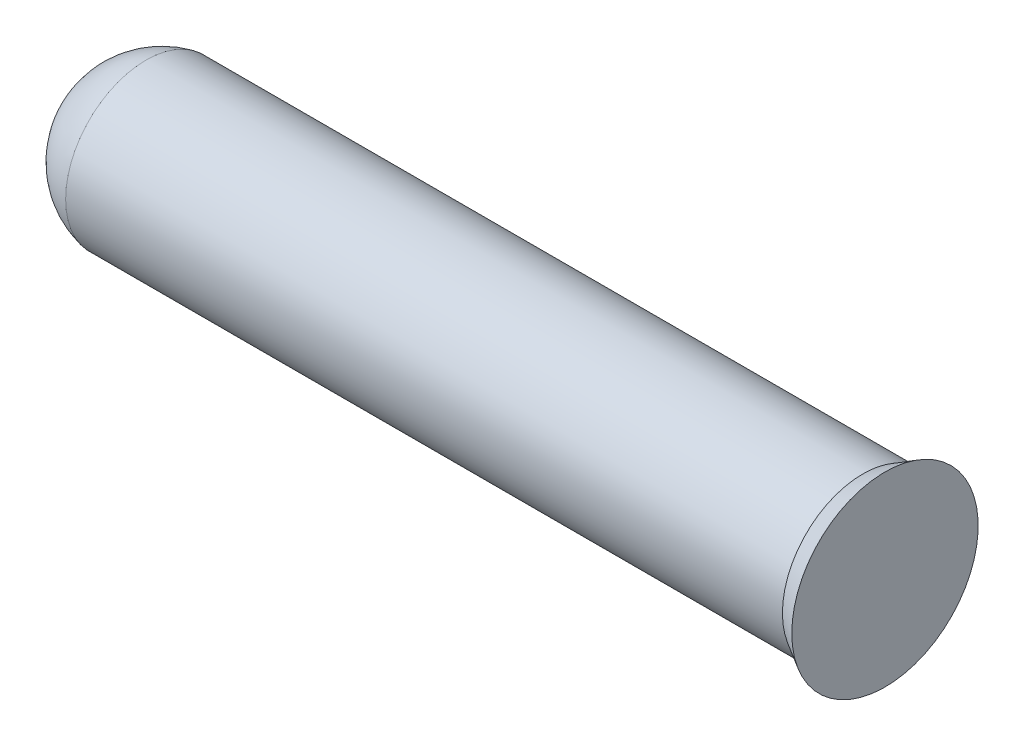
ISO-10303-21;
HEADER;
FILE_DESCRIPTION(('STEP AP214'),'2;1');
FILE_NAME('part.step','',(''),(''),'','','');
FILE_SCHEMA(('AUTOMOTIVE_DESIGN { 1 0 10303 214 1 1 1 1 }'));
ENDSEC;
DATA;
#1=APPLICATION_CONTEXT('core data for automotive mechanical design processes');
#2=APPLICATION_PROTOCOL_DEFINITION('international standard','automotive_design',2000,#1);
#3=PRODUCT_CONTEXT('',#1,'mechanical');
#4=PRODUCT('Part','Part','',(#3));
#5=PRODUCT_RELATED_PRODUCT_CATEGORY('part','',(#4));
#6=PRODUCT_DEFINITION_FORMATION('','',#4);
#7=PRODUCT_DEFINITION_CONTEXT('part definition',#1,'design');
#8=PRODUCT_DEFINITION('design','',#6,#7);
#9=PRODUCT_DEFINITION_SHAPE('','',#8);
#10=(LENGTH_UNIT() NAMED_UNIT(*) SI_UNIT(.MILLI.,.METRE.));
#11=(NAMED_UNIT(*) PLANE_ANGLE_UNIT() SI_UNIT($,.RADIAN.));
#12=(NAMED_UNIT(*) SI_UNIT($,.STERADIAN.) SOLID_ANGLE_UNIT());
#13=UNCERTAINTY_MEASURE_WITH_UNIT(LENGTH_MEASURE(1.E-05),#10,'distance_accuracy_value','');
#14=(GEOMETRIC_REPRESENTATION_CONTEXT(3) GLOBAL_UNCERTAINTY_ASSIGNED_CONTEXT((#13)) GLOBAL_UNIT_ASSIGNED_CONTEXT((#10,
#11,#12)) REPRESENTATION_CONTEXT('',''));
#15=CARTESIAN_POINT('',(0.,0.,0.));
#16=DIRECTION('',(0.,0.,1.));
#17=DIRECTION('',(1.,0.,0.));
#18=AXIS2_PLACEMENT_3D('',#15,#16,#17);
#19=CARTESIAN_POINT('',(2.032,0.,0.));
#20=DIRECTION('',(-1.,0.,0.));
#21=DIRECTION('',(0.,1.,0.));
#22=AXIS2_PLACEMENT_3D('',#19,#20,#21);
#23=SPHERICAL_SURFACE('',#22,2.032);
#24=CARTESIAN_POINT('',(1.64086319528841,0.,0.));
#25=DIRECTION('',(-1.,0.,0.));
#26=DIRECTION('',(0.,0.,1.));
#27=AXIS2_PLACEMENT_3D('',#24,#25,#26);
#28=CIRCLE('',#27,1.994);
#29=CARTESIAN_POINT('',(1.64086319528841,0.,1.994));
#30=VERTEX_POINT('',#29);
#31=EDGE_CURVE('E40',#30,#30,#28,.T.);
#32=ORIENTED_EDGE('',*,*,#31,.T.);
#33=EDGE_LOOP('',(#32));
#34=FACE_BOUND('',#33,.T.);
#35=ADVANCED_FACE('F30',(#34),#23,.T.);
#36=CARTESIAN_POINT('',(19.964,0.,0.));
#37=DIRECTION('',(-1.,0.,0.));
#38=DIRECTION('',(0.,0.,1.));
#39=AXIS2_PLACEMENT_3D('',#36,#37,#38);
#40=PLANE('',#39);
#41=CARTESIAN_POINT('',(19.964,0.,0.));
#42=DIRECTION('',(-1.,0.,0.));
#43=DIRECTION('',(0.,0.,1.));
#44=AXIS2_PLACEMENT_3D('',#41,#42,#43);
#45=CIRCLE('',#44,2.311);
#46=CARTESIAN_POINT('',(19.964,0.,2.311));
#47=VERTEX_POINT('',#46);
#48=EDGE_CURVE('E10',#47,#47,#45,.T.);
#49=ORIENTED_EDGE('',*,*,#48,.F.);
#50=EDGE_LOOP('',(#49));
#51=FACE_BOUND('',#50,.T.);
#52=ADVANCED_FACE('F55',(#51),#40,.F.);
#53=CARTESIAN_POINT('',(19.964,0.,0.));
#54=DIRECTION('',(1.,0.,0.));
#55=DIRECTION('',(0.,0.,-1.));
#56=AXIS2_PLACEMENT_3D('',#53,#54,#55);
#57=CONICAL_SURFACE('',#56,2.311,0.523598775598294);
#58=CARTESIAN_POINT('',(19.4149398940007,0.,0.));
#59=DIRECTION('',(-1.,0.,0.));
#60=DIRECTION('',(0.,0.,1.));
#61=AXIS2_PLACEMENT_3D('',#58,#59,#60);
#62=CIRCLE('',#61,1.994);
#63=CARTESIAN_POINT('',(19.4149398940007,0.,1.994));
#64=VERTEX_POINT('',#63);
#65=EDGE_CURVE('E36',#64,#64,#62,.T.);
#66=ORIENTED_EDGE('',*,*,#65,.F.);
#67=EDGE_LOOP('',(#66));
#68=FACE_BOUND('',#67,.T.);
#69=ORIENTED_EDGE('',*,*,#48,.T.);
#70=EDGE_LOOP('',(#69));
#71=FACE_BOUND('',#70,.T.);
#72=ADVANCED_FACE('F50',(#68,#71),#57,.T.);
#73=CARTESIAN_POINT('',(0.,0.,0.));
#74=DIRECTION('',(-1.,0.,0.));
#75=DIRECTION('',(0.,0.,1.));
#76=AXIS2_PLACEMENT_3D('',#73,#74,#75);
#77=CYLINDRICAL_SURFACE('',#76,1.994);
#78=ORIENTED_EDGE('',*,*,#31,.F.);
#79=EDGE_LOOP('',(#78));
#80=FACE_BOUND('',#79,.T.);
#81=ORIENTED_EDGE('',*,*,#65,.T.);
#82=EDGE_LOOP('',(#81));
#83=FACE_BOUND('',#82,.T.);
#84=ADVANCED_FACE('F48',(#80,#83),#77,.T.);
#85=CLOSED_SHELL('',(#35,#52,#72,#84));
#86=MANIFOLD_SOLID_BREP('B2',#85);
#87=ADVANCED_BREP_SHAPE_REPRESENTATION('',(#18,#86),#14);
#88=SHAPE_DEFINITION_REPRESENTATION(#9,#87);
ENDSEC;
END-ISO-10303-21;
